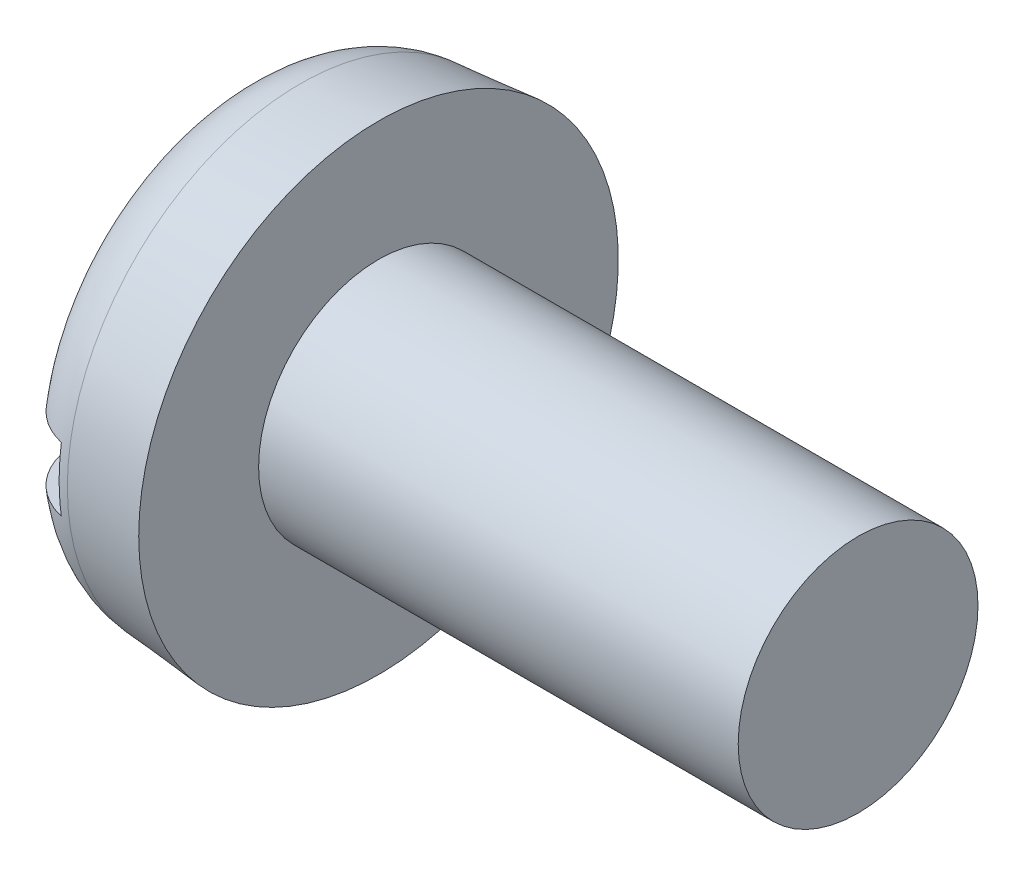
from build123d import *

# Parameters (mm, degrees)
FILLET2_R  = 1.8
SKETCH2_W  = 12
SKETCH2_H  = 1.6
SLOT_DEPTH = 1.4


with BuildPart() as part:
    # BodySke → Base-Revolve (revolve)
    with BuildSketch(Plane.XY, mode=Mode.PRIVATE) as base_revolve_sk:
        Polygon((3.6, 3), (3.6, 6), (0, 5.685040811), (0, 0), (15.6, 0), (15.6, 3), align=None)
    revolve(base_revolve_sk.sketch.rotate(Axis((-25.4, 0, 0), (1, 0, 0)), 90), axis=Axis((-25.4, 0, 0), (1, 0, 0)))

    # Fillet2
    fillet2_edges = [part.edges().sort_by_distance(p)[0] for p in [
        (0, 0, -5.685040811),
    ]]
    fillet(fillet2_edges, radius=FILLET2_R)

    # Sketch2 → Slot (cut)
    with BuildSketch(Plane(origin=(0, 0, 0), x_dir=(0, 0, -1), z_dir=(1, 0, 0))):
        Rectangle(SKETCH2_W, SKETCH2_H)
    extrude(amount=SLOT_DEPTH, mode=Mode.SUBTRACT)


solid = part.part
